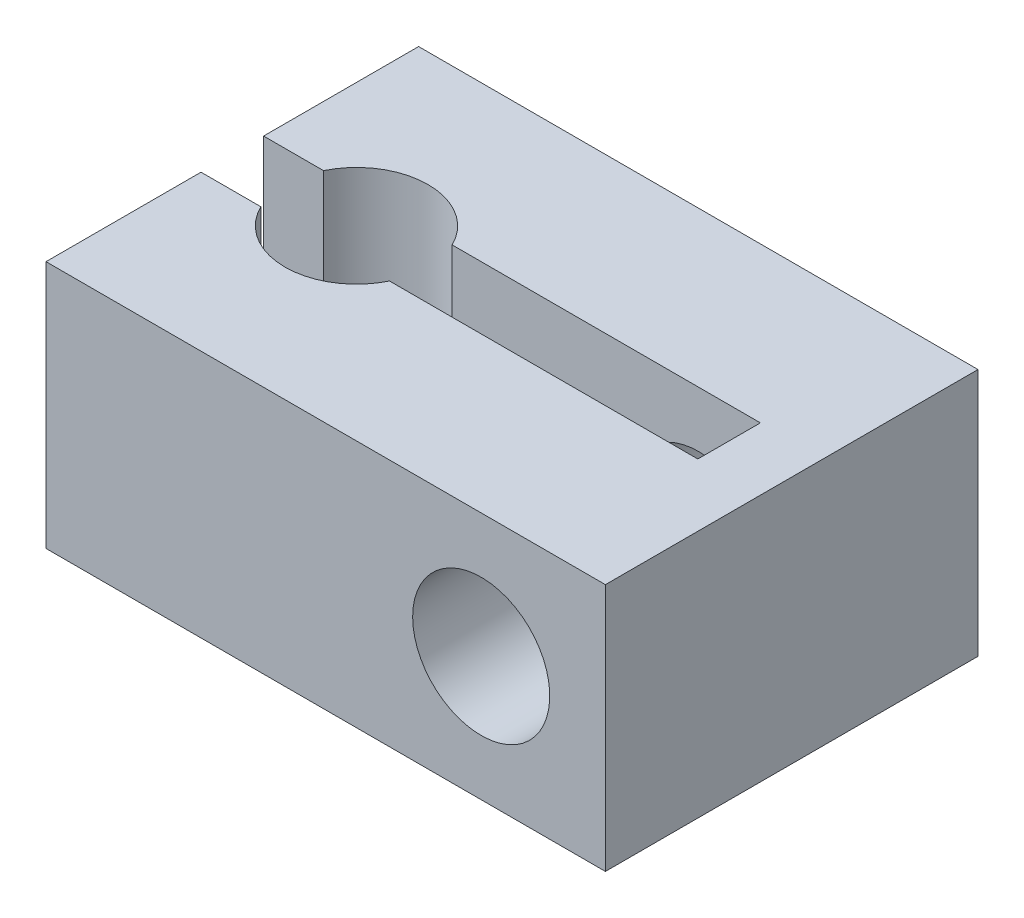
ISO-10303-21;
HEADER;
FILE_DESCRIPTION(('STEP AP214'),'2;1');
FILE_NAME('part.step','',(''),(''),'','','');
FILE_SCHEMA(('AUTOMOTIVE_DESIGN { 1 0 10303 214 1 1 1 1 }'));
ENDSEC;
DATA;
#1=APPLICATION_CONTEXT('core data for automotive mechanical design processes');
#2=APPLICATION_PROTOCOL_DEFINITION('international standard','automotive_design',2000,#1);
#3=PRODUCT_CONTEXT('',#1,'mechanical');
#4=PRODUCT('Part','Part','',(#3));
#5=PRODUCT_RELATED_PRODUCT_CATEGORY('part','',(#4));
#6=PRODUCT_DEFINITION_FORMATION('','',#4);
#7=PRODUCT_DEFINITION_CONTEXT('part definition',#1,'design');
#8=PRODUCT_DEFINITION('design','',#6,#7);
#9=PRODUCT_DEFINITION_SHAPE('','',#8);
#10=(LENGTH_UNIT() NAMED_UNIT(*) SI_UNIT(.MILLI.,.METRE.));
#11=(NAMED_UNIT(*) PLANE_ANGLE_UNIT() SI_UNIT($,.RADIAN.));
#12=(NAMED_UNIT(*) SI_UNIT($,.STERADIAN.) SOLID_ANGLE_UNIT());
#13=UNCERTAINTY_MEASURE_WITH_UNIT(LENGTH_MEASURE(1.E-05),#10,'distance_accuracy_value','');
#14=(GEOMETRIC_REPRESENTATION_CONTEXT(3) GLOBAL_UNCERTAINTY_ASSIGNED_CONTEXT((#13)) GLOBAL_UNIT_ASSIGNED_CONTEXT((#10,
#11,#12)) REPRESENTATION_CONTEXT('',''));
#15=CARTESIAN_POINT('',(0.,0.,0.));
#16=DIRECTION('',(0.,0.,1.));
#17=DIRECTION('',(1.,0.,0.));
#18=AXIS2_PLACEMENT_3D('',#15,#16,#17);
#19=CARTESIAN_POINT('',(5.5499,-3.175,-0.8001));
#20=DIRECTION('',(1.,0.,0.));
#21=DIRECTION('',(0.,0.,-1.));
#22=AXIS2_PLACEMENT_3D('',#19,#20,#21);
#23=PLANE('',#22);
#24=DIRECTION('',(0.,1.,0.));
#25=VECTOR('',#24,1.);
#26=CARTESIAN_POINT('',(5.5499,-3.175,0.8001));
#27=LINE('',#26,#25);
#28=CARTESIAN_POINT('',(5.5499,-3.175,0.8001));
#29=VERTEX_POINT('',#28);
#30=CARTESIAN_POINT('',(5.5499,-0.769162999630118,0.8001));
#31=VERTEX_POINT('',#30);
#32=EDGE_CURVE('E150',#29,#31,#27,.T.);
#33=ORIENTED_EDGE('',*,*,#32,.T.);
#34=DIRECTION('',(0.,0.,-1.));
#35=VECTOR('',#34,1.);
#36=CARTESIAN_POINT('',(5.5499,-0.769162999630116,4.76250000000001));
#37=LINE('',#36,#35);
#38=CARTESIAN_POINT('',(5.5499,-0.769162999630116,-0.800100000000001));
#39=VERTEX_POINT('',#38);
#40=EDGE_CURVE('E47',#31,#39,#37,.T.);
#41=ORIENTED_EDGE('',*,*,#40,.T.);
#42=DIRECTION('',(0.,1.,0.));
#43=VECTOR('',#42,1.);
#44=CARTESIAN_POINT('',(5.5499,-3.175,-0.8001));
#45=LINE('',#44,#43);
#46=CARTESIAN_POINT('',(5.5499,-3.175,-0.8001));
#47=VERTEX_POINT('',#46);
#48=EDGE_CURVE('E156',#47,#39,#45,.T.);
#49=ORIENTED_EDGE('',*,*,#48,.F.);
#50=DIRECTION('',(0.,0.,-1.));
#51=VECTOR('',#50,1.);
#52=CARTESIAN_POINT('',(5.5499,-3.175,-0.8001));
#53=LINE('',#52,#51);
#54=EDGE_CURVE('E259',#29,#47,#53,.T.);
#55=ORIENTED_EDGE('',*,*,#54,.F.);
#56=EDGE_LOOP('',(#33,#41,#49,#55));
#57=FACE_BOUND('',#56,.T.);
#58=ADVANCED_FACE('F32',(#57),#23,.F.);
#59=CARTESIAN_POINT('',(-7.1501,3.175,-4.7625));
#60=DIRECTION('',(1.,0.,0.));
#61=DIRECTION('',(0.,0.,-1.));
#62=AXIS2_PLACEMENT_3D('',#59,#60,#61);
#63=PLANE('',#62);
#64=DIRECTION('',(0.,0.,1.));
#65=VECTOR('',#64,1.);
#66=CARTESIAN_POINT('',(-7.1501,3.175,-4.7625));
#67=LINE('',#66,#65);
#68=CARTESIAN_POINT('',(-7.1501,3.175,0.800099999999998));
#69=VERTEX_POINT('',#68);
#70=CARTESIAN_POINT('',(-7.1501,3.175,4.7625));
#71=VERTEX_POINT('',#70);
#72=EDGE_CURVE('E170',#69,#71,#67,.T.);
#73=ORIENTED_EDGE('',*,*,#72,.F.);
#74=DIRECTION('',(0.,1.,0.));
#75=VECTOR('',#74,1.);
#76=CARTESIAN_POINT('',(-7.1501,-3.175,0.800099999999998));
#77=LINE('',#76,#75);
#78=CARTESIAN_POINT('',(-7.1501,-3.175,0.800099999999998));
#79=VERTEX_POINT('',#78);
#80=EDGE_CURVE('E160',#79,#69,#77,.T.);
#81=ORIENTED_EDGE('',*,*,#80,.F.);
#82=DIRECTION('',(0.,0.,1.));
#83=VECTOR('',#82,1.);
#84=CARTESIAN_POINT('',(-7.1501,-3.175,-4.7625));
#85=LINE('',#84,#83);
#86=CARTESIAN_POINT('',(-7.1501,-3.175,4.7625));
#87=VERTEX_POINT('',#86);
#88=EDGE_CURVE('E181',#79,#87,#85,.T.);
#89=ORIENTED_EDGE('',*,*,#88,.T.);
#90=DIRECTION('',(0.,-1.,0.));
#91=VECTOR('',#90,1.);
#92=CARTESIAN_POINT('',(-7.1501,3.175,4.7625));
#93=LINE('',#92,#91);
#94=EDGE_CURVE('E40',#71,#87,#93,.T.);
#95=ORIENTED_EDGE('',*,*,#94,.F.);
#96=EDGE_LOOP('',(#73,#81,#89,#95));
#97=FACE_BOUND('',#96,.T.);
#98=ADVANCED_FACE('F203',(#97),#63,.F.);
#99=CARTESIAN_POINT('',(-7.1501,-3.175,-4.7625));
#100=VERTEX_POINT('',#99);
#101=CARTESIAN_POINT('',(-7.1501,-3.175,-0.800099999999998));
#102=VERTEX_POINT('',#101);
#103=EDGE_CURVE('E177',#100,#102,#85,.T.);
#104=ORIENTED_EDGE('',*,*,#103,.T.);
#105=DIRECTION('',(0.,1.,0.));
#106=VECTOR('',#105,1.);
#107=CARTESIAN_POINT('',(-7.1501,-3.175,-0.800099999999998));
#108=LINE('',#107,#106);
#109=CARTESIAN_POINT('',(-7.1501,3.175,-0.800099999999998));
#110=VERTEX_POINT('',#109);
#111=EDGE_CURVE('E54',#102,#110,#108,.T.);
#112=ORIENTED_EDGE('',*,*,#111,.T.);
#113=CARTESIAN_POINT('',(-7.1501,3.175,-4.7625));
#114=VERTEX_POINT('',#113);
#115=EDGE_CURVE('E166',#114,#110,#67,.T.);
#116=ORIENTED_EDGE('',*,*,#115,.F.);
#117=DIRECTION('',(0.,-1.,0.));
#118=VECTOR('',#117,1.);
#119=CARTESIAN_POINT('',(-7.1501,3.175,-4.7625));
#120=LINE('',#119,#118);
#121=EDGE_CURVE('E176',#114,#100,#120,.T.);
#122=ORIENTED_EDGE('',*,*,#121,.T.);
#123=EDGE_LOOP('',(#104,#112,#116,#122));
#124=FACE_BOUND('',#123,.T.);
#125=ADVANCED_FACE('F34',(#124),#63,.F.);
#126=CARTESIAN_POINT('',(-7.1501,3.175,4.7625));
#127=DIRECTION('',(0.,0.,-1.));
#128=DIRECTION('',(-1.,0.,0.));
#129=AXIS2_PLACEMENT_3D('',#126,#127,#128);
#130=PLANE('',#129);
#131=CARTESIAN_POINT('',(3.9751,0.,4.76250000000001));
#132=DIRECTION('',(0.,0.,-1.));
#133=DIRECTION('',(-1.,0.,0.));
#134=AXIS2_PLACEMENT_3D('',#131,#132,#133);
#135=CIRCLE('',#134,1.7526);
#136=CARTESIAN_POINT('',(2.2225,0.,4.76250000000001));
#137=VERTEX_POINT('',#136);
#138=EDGE_CURVE('E144',#137,#137,#135,.T.);
#139=ORIENTED_EDGE('',*,*,#138,.T.);
#140=EDGE_LOOP('',(#139));
#141=FACE_BOUND('',#140,.T.);
#142=DIRECTION('',(1.,0.,0.));
#143=VECTOR('',#142,1.);
#144=CARTESIAN_POINT('',(-7.1501,-3.175,4.7625));
#145=LINE('',#144,#143);
#146=CARTESIAN_POINT('',(7.1501,-3.175,4.7625));
#147=VERTEX_POINT('',#146);
#148=EDGE_CURVE('E180',#87,#147,#145,.T.);
#149=ORIENTED_EDGE('',*,*,#148,.T.);
#150=DIRECTION('',(0.,-1.,0.));
#151=VECTOR('',#150,1.);
#152=CARTESIAN_POINT('',(7.1501,3.175,4.7625));
#153=LINE('',#152,#151);
#154=CARTESIAN_POINT('',(7.1501,3.175,4.7625));
#155=VERTEX_POINT('',#154);
#156=EDGE_CURVE('E192',#155,#147,#153,.T.);
#157=ORIENTED_EDGE('',*,*,#156,.F.);
#158=DIRECTION('',(1.,0.,0.));
#159=VECTOR('',#158,1.);
#160=CARTESIAN_POINT('',(-7.1501,3.175,4.7625));
#161=LINE('',#160,#159);
#162=EDGE_CURVE('E169',#71,#155,#161,.T.);
#163=ORIENTED_EDGE('',*,*,#162,.F.);
#164=ORIENTED_EDGE('',*,*,#94,.T.);
#165=EDGE_LOOP('',(#149,#157,#163,#164));
#166=FACE_BOUND('',#165,.T.);
#167=ADVANCED_FACE('F198',(#141,#166),#130,.F.);
#168=CARTESIAN_POINT('',(7.1501,3.175,-4.7625));
#169=DIRECTION('',(-1.,0.,0.));
#170=DIRECTION('',(0.,0.,1.));
#171=AXIS2_PLACEMENT_3D('',#168,#169,#170);
#172=PLANE('',#171);
#173=DIRECTION('',(0.,0.,-1.));
#174=VECTOR('',#173,1.);
#175=CARTESIAN_POINT('',(7.1501,-3.175,-4.7625));
#176=LINE('',#175,#174);
#177=CARTESIAN_POINT('',(7.1501,-3.175,-4.7625));
#178=VERTEX_POINT('',#177);
#179=EDGE_CURVE('E183',#147,#178,#176,.T.);
#180=ORIENTED_EDGE('',*,*,#179,.T.);
#181=DIRECTION('',(0.,-1.,0.));
#182=VECTOR('',#181,1.);
#183=CARTESIAN_POINT('',(7.1501,3.175,-4.7625));
#184=LINE('',#183,#182);
#185=CARTESIAN_POINT('',(7.1501,3.175,-4.7625));
#186=VERTEX_POINT('',#185);
#187=EDGE_CURVE('E189',#186,#178,#184,.T.);
#188=ORIENTED_EDGE('',*,*,#187,.F.);
#189=DIRECTION('',(0.,0.,-1.));
#190=VECTOR('',#189,1.);
#191=CARTESIAN_POINT('',(7.1501,3.175,-4.7625));
#192=LINE('',#191,#190);
#193=EDGE_CURVE('E172',#155,#186,#192,.T.);
#194=ORIENTED_EDGE('',*,*,#193,.F.);
#195=ORIENTED_EDGE('',*,*,#156,.T.);
#196=EDGE_LOOP('',(#180,#188,#194,#195));
#197=FACE_BOUND('',#196,.T.);
#198=ADVANCED_FACE('F215',(#197),#172,.F.);
#199=CARTESIAN_POINT('',(-7.1501,3.175,-4.7625));
#200=DIRECTION('',(0.,0.,1.));
#201=DIRECTION('',(1.,0.,0.));
#202=AXIS2_PLACEMENT_3D('',#199,#200,#201);
#203=PLANE('',#202);
#204=CARTESIAN_POINT('',(3.9751,0.,-4.7625));
#205=DIRECTION('',(0.,0.,-1.));
#206=DIRECTION('',(-1.,0.,0.));
#207=AXIS2_PLACEMENT_3D('',#204,#205,#206);
#208=CIRCLE('',#207,1.7526);
#209=CARTESIAN_POINT('',(2.2225,0.,-4.7625));
#210=VERTEX_POINT('',#209);
#211=EDGE_CURVE('E275',#210,#210,#208,.T.);
#212=ORIENTED_EDGE('',*,*,#211,.F.);
#213=EDGE_LOOP('',(#212));
#214=FACE_BOUND('',#213,.T.);
#215=DIRECTION('',(-1.,0.,0.));
#216=VECTOR('',#215,1.);
#217=CARTESIAN_POINT('',(-7.1501,-3.175,-4.7625));
#218=LINE('',#217,#216);
#219=EDGE_CURVE('E185',#178,#100,#218,.T.);
#220=ORIENTED_EDGE('',*,*,#219,.T.);
#221=ORIENTED_EDGE('',*,*,#121,.F.);
#222=DIRECTION('',(-1.,0.,0.));
#223=VECTOR('',#222,1.);
#224=CARTESIAN_POINT('',(-7.1501,3.175,-4.7625));
#225=LINE('',#224,#223);
#226=EDGE_CURVE('E174',#186,#114,#225,.T.);
#227=ORIENTED_EDGE('',*,*,#226,.F.);
#228=ORIENTED_EDGE('',*,*,#187,.T.);
#229=EDGE_LOOP('',(#220,#221,#227,#228));
#230=FACE_BOUND('',#229,.T.);
#231=ADVANCED_FACE('F219',(#214,#230),#203,.F.);
#232=CARTESIAN_POINT('',(-7.1501,3.175,4.7625));
#233=DIRECTION('',(0.,1.,0.));
#234=DIRECTION('',(0.,0.,1.));
#235=AXIS2_PLACEMENT_3D('',#232,#233,#234);
#236=PLANE('',#235);
#237=DIRECTION('',(1.,0.,0.));
#238=VECTOR('',#237,1.);
#239=CARTESIAN_POINT('',(-7.1501,3.175,0.800099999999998));
#240=LINE('',#239,#238);
#241=CARTESIAN_POINT('',(-5.61959062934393,3.175,0.800099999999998));
#242=VERTEX_POINT('',#241);
#243=EDGE_CURVE('E228',#69,#242,#240,.T.);
#244=ORIENTED_EDGE('',*,*,#243,.F.);
#245=ORIENTED_EDGE('',*,*,#72,.T.);
#246=ORIENTED_EDGE('',*,*,#162,.T.);
#247=ORIENTED_EDGE('',*,*,#193,.T.);
#248=ORIENTED_EDGE('',*,*,#226,.T.);
#249=ORIENTED_EDGE('',*,*,#115,.T.);
#250=DIRECTION('',(-1.,0.,0.));
#251=VECTOR('',#250,1.);
#252=CARTESIAN_POINT('',(-7.1501,3.175,-0.800099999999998));
#253=LINE('',#252,#251);
#254=CARTESIAN_POINT('',(-5.61959062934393,3.175,-0.800099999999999));
#255=VERTEX_POINT('',#254);
#256=EDGE_CURVE('E232',#255,#110,#253,.T.);
#257=ORIENTED_EDGE('',*,*,#256,.F.);
#258=CARTESIAN_POINT('',(-3.9751,3.175,0.));
#259=DIRECTION('',(0.,1.,0.));
#260=DIRECTION('',(0.,0.,1.));
#261=AXIS2_PLACEMENT_3D('',#258,#259,#260);
#262=CIRCLE('',#261,1.8288);
#263=CARTESIAN_POINT('',(-2.33060937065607,3.175,-0.800099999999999));
#264=VERTEX_POINT('',#263);
#265=EDGE_CURVE('E235',#264,#255,#262,.T.);
#266=ORIENTED_EDGE('',*,*,#265,.F.);
#267=DIRECTION('',(-1.,0.,0.));
#268=VECTOR('',#267,1.);
#269=CARTESIAN_POINT('',(-2.33060937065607,3.175,-0.800099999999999));
#270=LINE('',#269,#268);
#271=CARTESIAN_POINT('',(5.5499,3.175,-0.8001));
#272=VERTEX_POINT('',#271);
#273=EDGE_CURVE('E242',#272,#264,#270,.T.);
#274=ORIENTED_EDGE('',*,*,#273,.F.);
#275=DIRECTION('',(0.,0.,-1.));
#276=VECTOR('',#275,1.);
#277=CARTESIAN_POINT('',(5.5499,3.175,-0.8001));
#278=LINE('',#277,#276);
#279=CARTESIAN_POINT('',(5.5499,3.175,0.8001));
#280=VERTEX_POINT('',#279);
#281=EDGE_CURVE('E240',#280,#272,#278,.T.);
#282=ORIENTED_EDGE('',*,*,#281,.F.);
#283=DIRECTION('',(1.,0.,0.));
#284=VECTOR('',#283,1.);
#285=CARTESIAN_POINT('',(-2.33060937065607,3.175,0.800099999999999));
#286=LINE('',#285,#284);
#287=CARTESIAN_POINT('',(-2.33060937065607,3.175,0.800099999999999));
#288=VERTEX_POINT('',#287);
#289=EDGE_CURVE('E148',#288,#280,#286,.T.);
#290=ORIENTED_EDGE('',*,*,#289,.F.);
#291=CARTESIAN_POINT('',(-3.9751,3.175,0.));
#292=DIRECTION('',(0.,1.,0.));
#293=DIRECTION('',(0.,0.,1.));
#294=AXIS2_PLACEMENT_3D('',#291,#292,#293);
#295=CIRCLE('',#294,1.8288);
#296=EDGE_CURVE('E230',#242,#288,#295,.T.);
#297=ORIENTED_EDGE('',*,*,#296,.F.);
#298=EDGE_LOOP('',(#244,#245,#246,#247,#248,#249,#257,#266,#274,#282,#290,#297));
#299=FACE_BOUND('',#298,.T.);
#300=ADVANCED_FACE('F224',(#299),#236,.T.);
#301=CARTESIAN_POINT('',(-7.1501,-3.175,4.7625));
#302=DIRECTION('',(0.,1.,0.));
#303=DIRECTION('',(0.,0.,1.));
#304=AXIS2_PLACEMENT_3D('',#301,#302,#303);
#305=PLANE('',#304);
#306=ORIENTED_EDGE('',*,*,#88,.F.);
#307=DIRECTION('',(1.,0.,0.));
#308=VECTOR('',#307,1.);
#309=CARTESIAN_POINT('',(-7.1501,-3.175,0.800099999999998));
#310=LINE('',#309,#308);
#311=CARTESIAN_POINT('',(-5.61959062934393,-3.175,0.800099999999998));
#312=VERTEX_POINT('',#311);
#313=EDGE_CURVE('E268',#79,#312,#310,.T.);
#314=ORIENTED_EDGE('',*,*,#313,.T.);
#315=CARTESIAN_POINT('',(-3.9751,-3.175,0.));
#316=DIRECTION('',(0.,1.,0.));
#317=DIRECTION('',(0.,0.,1.));
#318=AXIS2_PLACEMENT_3D('',#315,#316,#317);
#319=CIRCLE('',#318,1.8288);
#320=CARTESIAN_POINT('',(-2.33060937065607,-3.175,0.800099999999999));
#321=VERTEX_POINT('',#320);
#322=EDGE_CURVE('E265',#312,#321,#319,.T.);
#323=ORIENTED_EDGE('',*,*,#322,.T.);
#324=DIRECTION('',(1.,0.,0.));
#325=VECTOR('',#324,1.);
#326=CARTESIAN_POINT('',(-2.33060937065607,-3.175,0.800099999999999));
#327=LINE('',#326,#325);
#328=EDGE_CURVE('E262',#321,#29,#327,.T.);
#329=ORIENTED_EDGE('',*,*,#328,.T.);
#330=ORIENTED_EDGE('',*,*,#54,.T.);
#331=DIRECTION('',(-1.,0.,0.));
#332=VECTOR('',#331,1.);
#333=CARTESIAN_POINT('',(-2.33060937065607,-3.175,-0.800099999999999));
#334=LINE('',#333,#332);
#335=CARTESIAN_POINT('',(-2.33060937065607,-3.175,-0.800099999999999));
#336=VERTEX_POINT('',#335);
#337=EDGE_CURVE('E165',#47,#336,#334,.T.);
#338=ORIENTED_EDGE('',*,*,#337,.T.);
#339=CARTESIAN_POINT('',(-3.9751,-3.175,0.));
#340=DIRECTION('',(0.,1.,0.));
#341=DIRECTION('',(0.,0.,1.));
#342=AXIS2_PLACEMENT_3D('',#339,#340,#341);
#343=CIRCLE('',#342,1.8288);
#344=CARTESIAN_POINT('',(-5.61959062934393,-3.175,-0.800099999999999));
#345=VERTEX_POINT('',#344);
#346=EDGE_CURVE('E244',#336,#345,#343,.T.);
#347=ORIENTED_EDGE('',*,*,#346,.T.);
#348=DIRECTION('',(-1.,0.,0.));
#349=VECTOR('',#348,1.);
#350=CARTESIAN_POINT('',(-7.1501,-3.175,-0.800099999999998));
#351=LINE('',#350,#349);
#352=EDGE_CURVE('E270',#345,#102,#351,.T.);
#353=ORIENTED_EDGE('',*,*,#352,.T.);
#354=ORIENTED_EDGE('',*,*,#103,.F.);
#355=ORIENTED_EDGE('',*,*,#219,.F.);
#356=ORIENTED_EDGE('',*,*,#179,.F.);
#357=ORIENTED_EDGE('',*,*,#148,.F.);
#358=EDGE_LOOP('',(#306,#314,#323,#329,#330,#338,#347,#353,#354,#355,#356,#357));
#359=FACE_BOUND('',#358,.T.);
#360=ADVANCED_FACE('F210',(#359),#305,.F.);
#361=CARTESIAN_POINT('',(-3.9751,-3.175,0.));
#362=DIRECTION('',(0.,1.,0.));
#363=DIRECTION('',(0.,0.,1.));
#364=AXIS2_PLACEMENT_3D('',#361,#362,#363);
#365=CYLINDRICAL_SURFACE('',#364,1.8288);
#366=ORIENTED_EDGE('',*,*,#265,.T.);
#367=DIRECTION('',(0.,1.,0.));
#368=VECTOR('',#367,1.);
#369=CARTESIAN_POINT('',(-5.61959062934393,-3.175,-0.800099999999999));
#370=LINE('',#369,#368);
#371=EDGE_CURVE('E163',#345,#255,#370,.T.);
#372=ORIENTED_EDGE('',*,*,#371,.F.);
#373=ORIENTED_EDGE('',*,*,#346,.F.);
#374=DIRECTION('',(0.,1.,0.));
#375=VECTOR('',#374,1.);
#376=CARTESIAN_POINT('',(-2.33060937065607,-3.175,-0.800099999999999));
#377=LINE('',#376,#375);
#378=EDGE_CURVE('E208',#336,#264,#377,.T.);
#379=ORIENTED_EDGE('',*,*,#378,.T.);
#380=EDGE_LOOP('',(#366,#372,#373,#379));
#381=FACE_BOUND('',#380,.T.);
#382=ADVANCED_FACE('F305',(#381),#365,.F.);
#383=CARTESIAN_POINT('',(-2.33060937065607,-3.175,-0.800099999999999));
#384=DIRECTION('',(0.,0.,-1.));
#385=DIRECTION('',(-1.,0.,0.));
#386=AXIS2_PLACEMENT_3D('',#383,#384,#385);
#387=PLANE('',#386);
#388=ORIENTED_EDGE('',*,*,#48,.T.);
#389=CARTESIAN_POINT('',(3.9751,0.,-0.8001));
#390=DIRECTION('',(0.,0.,-1.));
#391=DIRECTION('',(-1.,0.,0.));
#392=AXIS2_PLACEMENT_3D('',#389,#390,#391);
#393=CIRCLE('',#392,1.7526);
#394=CARTESIAN_POINT('',(5.5499,0.769162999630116,-0.800100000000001));
#395=VERTEX_POINT('',#394);
#396=EDGE_CURVE('E254',#39,#395,#393,.T.);
#397=ORIENTED_EDGE('',*,*,#396,.T.);
#398=EDGE_CURVE('E143',#395,#272,#45,.T.);
#399=ORIENTED_EDGE('',*,*,#398,.T.);
#400=ORIENTED_EDGE('',*,*,#273,.T.);
#401=ORIENTED_EDGE('',*,*,#378,.F.);
#402=ORIENTED_EDGE('',*,*,#337,.F.);
#403=EDGE_LOOP('',(#388,#397,#399,#400,#401,#402));
#404=FACE_BOUND('',#403,.T.);
#405=ADVANCED_FACE('F251',(#404),#387,.F.);
#406=ORIENTED_EDGE('',*,*,#398,.F.);
#407=DIRECTION('',(0.,0.,-1.));
#408=VECTOR('',#407,1.);
#409=CARTESIAN_POINT('',(5.5499,0.769162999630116,4.76250000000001));
#410=LINE('',#409,#408);
#411=CARTESIAN_POINT('',(5.5499,0.769162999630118,0.8001));
#412=VERTEX_POINT('',#411);
#413=EDGE_CURVE('E132',#395,#412,#410,.F.);
#414=ORIENTED_EDGE('',*,*,#413,.T.);
#415=EDGE_CURVE('E141',#412,#280,#27,.T.);
#416=ORIENTED_EDGE('',*,*,#415,.T.);
#417=ORIENTED_EDGE('',*,*,#281,.T.);
#418=EDGE_LOOP('',(#406,#414,#416,#417));
#419=FACE_BOUND('',#418,.T.);
#420=ADVANCED_FACE('F139',(#419),#23,.F.);
#421=CARTESIAN_POINT('',(-2.33060937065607,-3.175,0.800099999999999));
#422=DIRECTION('',(0.,0.,1.));
#423=DIRECTION('',(1.,0.,0.));
#424=AXIS2_PLACEMENT_3D('',#421,#422,#423);
#425=PLANE('',#424);
#426=ORIENTED_EDGE('',*,*,#415,.F.);
#427=CARTESIAN_POINT('',(3.9751,0.,0.8001));
#428=DIRECTION('',(0.,0.,1.));
#429=DIRECTION('',(1.,0.,0.));
#430=AXIS2_PLACEMENT_3D('',#427,#428,#429);
#431=CIRCLE('',#430,1.7526);
#432=EDGE_CURVE('E11',#412,#31,#431,.T.);
#433=ORIENTED_EDGE('',*,*,#432,.T.);
#434=ORIENTED_EDGE('',*,*,#32,.F.);
#435=ORIENTED_EDGE('',*,*,#328,.F.);
#436=DIRECTION('',(0.,1.,0.));
#437=VECTOR('',#436,1.);
#438=CARTESIAN_POINT('',(-2.33060937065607,-3.175,0.800099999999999));
#439=LINE('',#438,#437);
#440=EDGE_CURVE('E151',#321,#288,#439,.T.);
#441=ORIENTED_EDGE('',*,*,#440,.T.);
#442=ORIENTED_EDGE('',*,*,#289,.T.);
#443=EDGE_LOOP('',(#426,#433,#434,#435,#441,#442));
#444=FACE_BOUND('',#443,.T.);
#445=ADVANCED_FACE('F146',(#444),#425,.F.);
#446=CARTESIAN_POINT('',(-3.9751,-3.175,0.));
#447=DIRECTION('',(0.,1.,0.));
#448=DIRECTION('',(0.,0.,1.));
#449=AXIS2_PLACEMENT_3D('',#446,#447,#448);
#450=CYLINDRICAL_SURFACE('',#449,1.8288);
#451=ORIENTED_EDGE('',*,*,#296,.T.);
#452=ORIENTED_EDGE('',*,*,#440,.F.);
#453=ORIENTED_EDGE('',*,*,#322,.F.);
#454=DIRECTION('',(0.,1.,0.));
#455=VECTOR('',#454,1.);
#456=CARTESIAN_POINT('',(-5.61959062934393,-3.175,0.800099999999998));
#457=LINE('',#456,#455);
#458=EDGE_CURVE('E153',#312,#242,#457,.T.);
#459=ORIENTED_EDGE('',*,*,#458,.T.);
#460=EDGE_LOOP('',(#451,#452,#453,#459));
#461=FACE_BOUND('',#460,.T.);
#462=ADVANCED_FACE('F304',(#461),#450,.F.);
#463=CARTESIAN_POINT('',(-7.1501,-3.175,0.800099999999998));
#464=DIRECTION('',(0.,0.,1.));
#465=DIRECTION('',(1.,0.,0.));
#466=AXIS2_PLACEMENT_3D('',#463,#464,#465);
#467=PLANE('',#466);
#468=ORIENTED_EDGE('',*,*,#243,.T.);
#469=ORIENTED_EDGE('',*,*,#458,.F.);
#470=ORIENTED_EDGE('',*,*,#313,.F.);
#471=ORIENTED_EDGE('',*,*,#80,.T.);
#472=EDGE_LOOP('',(#468,#469,#470,#471));
#473=FACE_BOUND('',#472,.T.);
#474=ADVANCED_FACE('F289',(#473),#467,.F.);
#475=CARTESIAN_POINT('',(-7.1501,-3.175,-0.800099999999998));
#476=DIRECTION('',(0.,0.,-1.));
#477=DIRECTION('',(-1.,0.,0.));
#478=AXIS2_PLACEMENT_3D('',#475,#476,#477);
#479=PLANE('',#478);
#480=ORIENTED_EDGE('',*,*,#256,.T.);
#481=ORIENTED_EDGE('',*,*,#111,.F.);
#482=ORIENTED_EDGE('',*,*,#352,.F.);
#483=ORIENTED_EDGE('',*,*,#371,.T.);
#484=EDGE_LOOP('',(#480,#481,#482,#483));
#485=FACE_BOUND('',#484,.T.);
#486=ADVANCED_FACE('F283',(#485),#479,.F.);
#487=CARTESIAN_POINT('',(3.9751,0.,4.76250000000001));
#488=DIRECTION('',(0.,0.,-1.));
#489=DIRECTION('',(-1.,0.,0.));
#490=AXIS2_PLACEMENT_3D('',#487,#488,#489);
#491=CYLINDRICAL_SURFACE('',#490,1.7526);
#492=ORIENTED_EDGE('',*,*,#211,.T.);
#493=EDGE_LOOP('',(#492));
#494=FACE_BOUND('',#493,.T.);
#495=ORIENTED_EDGE('',*,*,#138,.F.);
#496=EDGE_LOOP('',(#495));
#497=FACE_BOUND('',#496,.T.);
#498=ORIENTED_EDGE('',*,*,#40,.F.);
#499=ORIENTED_EDGE('',*,*,#432,.F.);
#500=ORIENTED_EDGE('',*,*,#413,.F.);
#501=ORIENTED_EDGE('',*,*,#396,.F.);
#502=EDGE_LOOP('',(#498,#499,#500,#501));
#503=FACE_BOUND('',#502,.T.);
#504=ADVANCED_FACE('F131',(#494,#497,#503),#491,.F.);
#505=CLOSED_SHELL('',(#58,#98,#125,#167,#198,#231,#300,#360,#382,#405,#420,#445,#462,#474,#486,#504));
#506=MANIFOLD_SOLID_BREP('B2',#505);
#507=ADVANCED_BREP_SHAPE_REPRESENTATION('',(#18,#506),#14);
#508=SHAPE_DEFINITION_REPRESENTATION(#9,#507);
ENDSEC;
END-ISO-10303-21;
